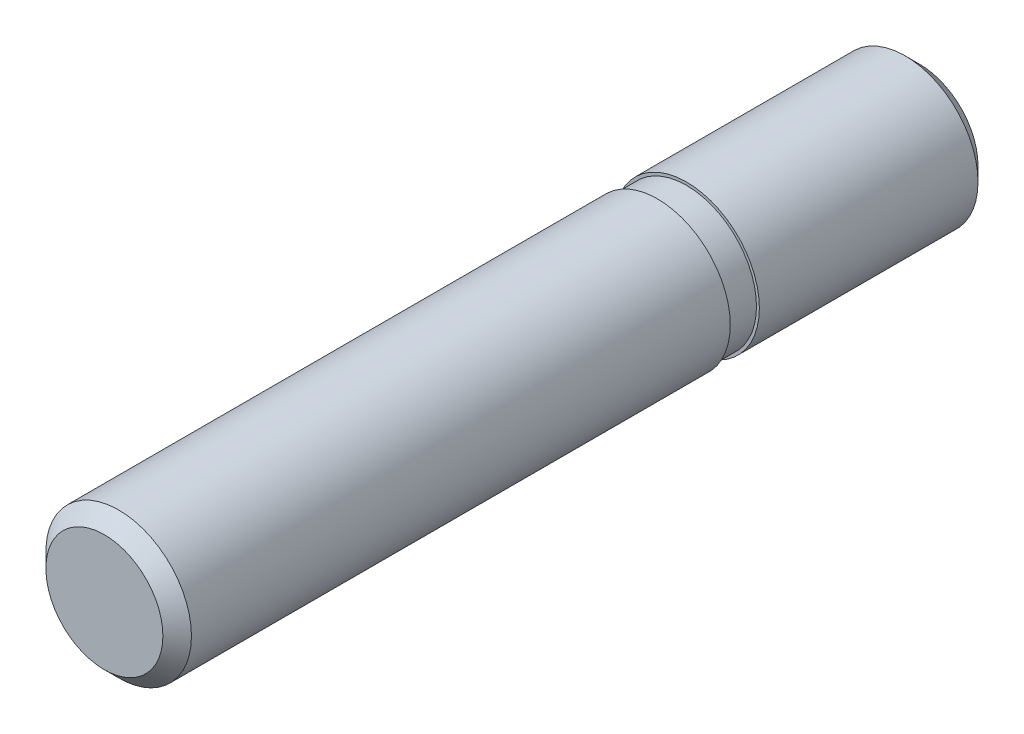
ISO-10303-21;
HEADER;
FILE_DESCRIPTION(('STEP AP214'),'2;1');
FILE_NAME('part.step','',(''),(''),'','','');
FILE_SCHEMA(('AUTOMOTIVE_DESIGN { 1 0 10303 214 1 1 1 1 }'));
ENDSEC;
DATA;
#1=APPLICATION_CONTEXT('core data for automotive mechanical design processes');
#2=APPLICATION_PROTOCOL_DEFINITION('international standard','automotive_design',2000,#1);
#3=PRODUCT_CONTEXT('',#1,'mechanical');
#4=PRODUCT('Part','Part','',(#3));
#5=PRODUCT_RELATED_PRODUCT_CATEGORY('part','',(#4));
#6=PRODUCT_DEFINITION_FORMATION('','',#4);
#7=PRODUCT_DEFINITION_CONTEXT('part definition',#1,'design');
#8=PRODUCT_DEFINITION('design','',#6,#7);
#9=PRODUCT_DEFINITION_SHAPE('','',#8);
#10=(LENGTH_UNIT() NAMED_UNIT(*) SI_UNIT(.MILLI.,.METRE.));
#11=(NAMED_UNIT(*) PLANE_ANGLE_UNIT() SI_UNIT($,.RADIAN.));
#12=(NAMED_UNIT(*) SI_UNIT($,.STERADIAN.) SOLID_ANGLE_UNIT());
#13=UNCERTAINTY_MEASURE_WITH_UNIT(LENGTH_MEASURE(1.E-05),#10,'distance_accuracy_value','');
#14=(GEOMETRIC_REPRESENTATION_CONTEXT(3) GLOBAL_UNCERTAINTY_ASSIGNED_CONTEXT((#13)) GLOBAL_UNIT_ASSIGNED_CONTEXT((#10,
#11,#12)) REPRESENTATION_CONTEXT('',''));
#15=CARTESIAN_POINT('',(0.,0.,0.));
#16=DIRECTION('',(0.,0.,1.));
#17=DIRECTION('',(1.,0.,0.));
#18=AXIS2_PLACEMENT_3D('',#15,#16,#17);
#19=CARTESIAN_POINT('',(0.,1.00475,-8.));
#20=DIRECTION('',(0.,0.,-1.));
#21=DIRECTION('',(-1.,0.,0.));
#22=AXIS2_PLACEMENT_3D('',#19,#20,#21);
#23=PLANE('',#22);
#24=CARTESIAN_POINT('',(0.,0.,-8.00000000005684));
#25=DIRECTION('',(0.,0.,1.));
#26=DIRECTION('',(1.,0.,0.));
#27=AXIS2_PLACEMENT_3D('',#24,#25,#26);
#28=CIRCLE('',#27,2.00949999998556);
#29=CARTESIAN_POINT('',(2.00949999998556,0.,-8.00000000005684));
#30=VERTEX_POINT('',#29);
#31=EDGE_CURVE('E27',#30,#30,#28,.T.);
#32=ORIENTED_EDGE('',*,*,#31,.F.);
#33=EDGE_LOOP('',(#32));
#34=FACE_BOUND('',#33,.T.);
#35=ADVANCED_FACE('F12',(#34),#23,.T.);
#36=CARTESIAN_POINT('',(0.,0.,-7.50950000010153));
#37=DIRECTION('',(0.,0.,1.));
#38=DIRECTION('',(1.,0.,0.));
#39=AXIS2_PLACEMENT_3D('',#36,#37,#38);
#40=CONICAL_SURFACE('',#39,2.49999999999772,0.785398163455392);
#41=CARTESIAN_POINT('',(0.,0.,-7.5095));
#42=DIRECTION('',(0.,0.,1.));
#43=DIRECTION('',(1.,0.,0.));
#44=AXIS2_PLACEMENT_3D('',#41,#42,#43);
#45=CIRCLE('',#44,2.5);
#46=CARTESIAN_POINT('',(2.5,0.,-7.5095));
#47=VERTEX_POINT('',#46);
#48=EDGE_CURVE('E30',#47,#47,#45,.T.);
#49=ORIENTED_EDGE('',*,*,#48,.F.);
#50=EDGE_LOOP('',(#49));
#51=FACE_BOUND('',#50,.T.);
#52=ORIENTED_EDGE('',*,*,#31,.T.);
#53=EDGE_LOOP('',(#52));
#54=FACE_BOUND('',#53,.T.);
#55=ADVANCED_FACE('F64',(#51,#54),#40,.T.);
#56=CARTESIAN_POINT('',(0.,0.,6.5));
#57=DIRECTION('',(0.,0.,1.));
#58=DIRECTION('',(1.,0.,0.));
#59=AXIS2_PLACEMENT_3D('',#56,#57,#58);
#60=CYLINDRICAL_SURFACE('',#59,2.5);
#61=CARTESIAN_POINT('',(0.,0.,0.));
#62=DIRECTION('',(0.,0.,1.));
#63=DIRECTION('',(1.,0.,0.));
#64=AXIS2_PLACEMENT_3D('',#61,#62,#63);
#65=CIRCLE('',#64,2.5);
#66=CARTESIAN_POINT('',(2.5,0.,0.));
#67=VERTEX_POINT('',#66);
#68=EDGE_CURVE('E33',#67,#67,#65,.T.);
#69=ORIENTED_EDGE('',*,*,#68,.F.);
#70=EDGE_LOOP('',(#69));
#71=FACE_BOUND('',#70,.T.);
#72=ORIENTED_EDGE('',*,*,#48,.T.);
#73=EDGE_LOOP('',(#72));
#74=FACE_BOUND('',#73,.T.);
#75=ADVANCED_FACE('F70',(#71,#74),#60,.T.);
#76=CARTESIAN_POINT('',(0.,0.,0.));
#77=DIRECTION('',(0.,0.,1.));
#78=DIRECTION('',(1.,0.,0.));
#79=AXIS2_PLACEMENT_3D('',#76,#77,#78);
#80=PLANE('',#79);
#81=CARTESIAN_POINT('',(0.,0.,0.));
#82=DIRECTION('',(0.,0.,1.));
#83=DIRECTION('',(1.,0.,0.));
#84=AXIS2_PLACEMENT_3D('',#81,#82,#83);
#85=CIRCLE('',#84,2.4);
#86=CARTESIAN_POINT('',(2.4,0.,0.));
#87=VERTEX_POINT('',#86);
#88=EDGE_CURVE('E8',#87,#87,#85,.T.);
#89=ORIENTED_EDGE('',*,*,#88,.F.);
#90=EDGE_LOOP('',(#89));
#91=FACE_BOUND('',#90,.T.);
#92=ORIENTED_EDGE('',*,*,#68,.T.);
#93=EDGE_LOOP('',(#92));
#94=FACE_BOUND('',#93,.T.);
#95=ADVANCED_FACE('F77',(#91,#94),#80,.T.);
#96=CARTESIAN_POINT('',(0.,0.,-1.59497686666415));
#97=DIRECTION('',(0.,0.,-1.));
#98=DIRECTION('',(-1.,0.,0.));
#99=AXIS2_PLACEMENT_3D('',#96,#97,#98);
#100=CYLINDRICAL_SURFACE('',#99,2.4);
#101=CARTESIAN_POINT('',(0.,0.,1.));
#102=DIRECTION('',(0.,0.,-1.));
#103=DIRECTION('',(-1.,0.,0.));
#104=AXIS2_PLACEMENT_3D('',#101,#102,#103);
#105=CIRCLE('',#104,2.4);
#106=CARTESIAN_POINT('',(-2.4,0.,1.));
#107=VERTEX_POINT('',#106);
#108=EDGE_CURVE('E37',#107,#107,#105,.T.);
#109=ORIENTED_EDGE('',*,*,#108,.T.);
#110=EDGE_LOOP('',(#109));
#111=FACE_BOUND('',#110,.T.);
#112=ORIENTED_EDGE('',*,*,#88,.T.);
#113=EDGE_LOOP('',(#112));
#114=FACE_BOUND('',#113,.T.);
#115=ADVANCED_FACE('F45',(#111,#114),#100,.T.);
#116=CARTESIAN_POINT('',(0.,0.,20.));
#117=DIRECTION('',(0.,0.,1.));
#118=DIRECTION('',(1.,0.,0.));
#119=AXIS2_PLACEMENT_3D('',#116,#117,#118);
#120=PLANE('',#119);
#121=CARTESIAN_POINT('',(0.,0.,20.));
#122=DIRECTION('',(0.,0.,1.));
#123=DIRECTION('',(1.,0.,0.));
#124=AXIS2_PLACEMENT_3D('',#121,#122,#123);
#125=CIRCLE('',#124,2.0095);
#126=CARTESIAN_POINT('',(2.0095,0.,20.));
#127=VERTEX_POINT('',#126);
#128=EDGE_CURVE('E23',#127,#127,#125,.T.);
#129=ORIENTED_EDGE('',*,*,#128,.T.);
#130=EDGE_LOOP('',(#129));
#131=FACE_BOUND('',#130,.T.);
#132=ADVANCED_FACE('F60',(#131),#120,.T.);
#133=CARTESIAN_POINT('',(0.,0.,20.));
#134=DIRECTION('',(0.,0.,-1.));
#135=DIRECTION('',(-1.,0.,0.));
#136=AXIS2_PLACEMENT_3D('',#133,#134,#135);
#137=CONICAL_SURFACE('',#136,2.0095,0.785398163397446);
#138=CARTESIAN_POINT('',(0.,0.,19.5095));
#139=DIRECTION('',(0.,0.,1.));
#140=DIRECTION('',(1.,0.,0.));
#141=AXIS2_PLACEMENT_3D('',#138,#139,#140);
#142=CIRCLE('',#141,2.5);
#143=CARTESIAN_POINT('',(2.5,0.,19.5095));
#144=VERTEX_POINT('',#143);
#145=EDGE_CURVE('E19',#144,#144,#142,.F.);
#146=ORIENTED_EDGE('',*,*,#145,.F.);
#147=EDGE_LOOP('',(#146));
#148=FACE_BOUND('',#147,.T.);
#149=ORIENTED_EDGE('',*,*,#128,.F.);
#150=EDGE_LOOP('',(#149));
#151=FACE_BOUND('',#150,.T.);
#152=ADVANCED_FACE('F54',(#148,#151),#137,.T.);
#153=CARTESIAN_POINT('',(0.,0.,6.5));
#154=DIRECTION('',(0.,0.,1.));
#155=DIRECTION('',(1.,0.,0.));
#156=AXIS2_PLACEMENT_3D('',#153,#154,#155);
#157=CYLINDRICAL_SURFACE('',#156,2.5);
#158=ORIENTED_EDGE('',*,*,#145,.T.);
#159=EDGE_LOOP('',(#158));
#160=FACE_BOUND('',#159,.T.);
#161=CARTESIAN_POINT('',(0.,0.,1.));
#162=DIRECTION('',(0.,0.,1.));
#163=DIRECTION('',(1.,0.,0.));
#164=AXIS2_PLACEMENT_3D('',#161,#162,#163);
#165=CIRCLE('',#164,2.5);
#166=CARTESIAN_POINT('',(2.5,0.,1.));
#167=VERTEX_POINT('',#166);
#168=EDGE_CURVE('E34',#167,#167,#165,.T.);
#169=ORIENTED_EDGE('',*,*,#168,.T.);
#170=EDGE_LOOP('',(#169));
#171=FACE_BOUND('',#170,.T.);
#172=ADVANCED_FACE('F14',(#160,#171),#157,.T.);
#173=CARTESIAN_POINT('',(0.,0.,1.));
#174=DIRECTION('',(0.,0.,1.));
#175=DIRECTION('',(1.,0.,0.));
#176=AXIS2_PLACEMENT_3D('',#173,#174,#175);
#177=PLANE('',#176);
#178=ORIENTED_EDGE('',*,*,#108,.F.);
#179=EDGE_LOOP('',(#178));
#180=FACE_BOUND('',#179,.T.);
#181=ORIENTED_EDGE('',*,*,#168,.F.);
#182=EDGE_LOOP('',(#181));
#183=FACE_BOUND('',#182,.T.);
#184=ADVANCED_FACE('F47',(#180,#183),#177,.F.);
#185=CLOSED_SHELL('',(#35,#55,#75,#95,#115,#132,#152,#172,#184));
#186=MANIFOLD_SOLID_BREP('B1',#185);
#187=ADVANCED_BREP_SHAPE_REPRESENTATION('',(#18,#186),#14);
#188=SHAPE_DEFINITION_REPRESENTATION(#9,#187);
ENDSEC;
END-ISO-10303-21;
